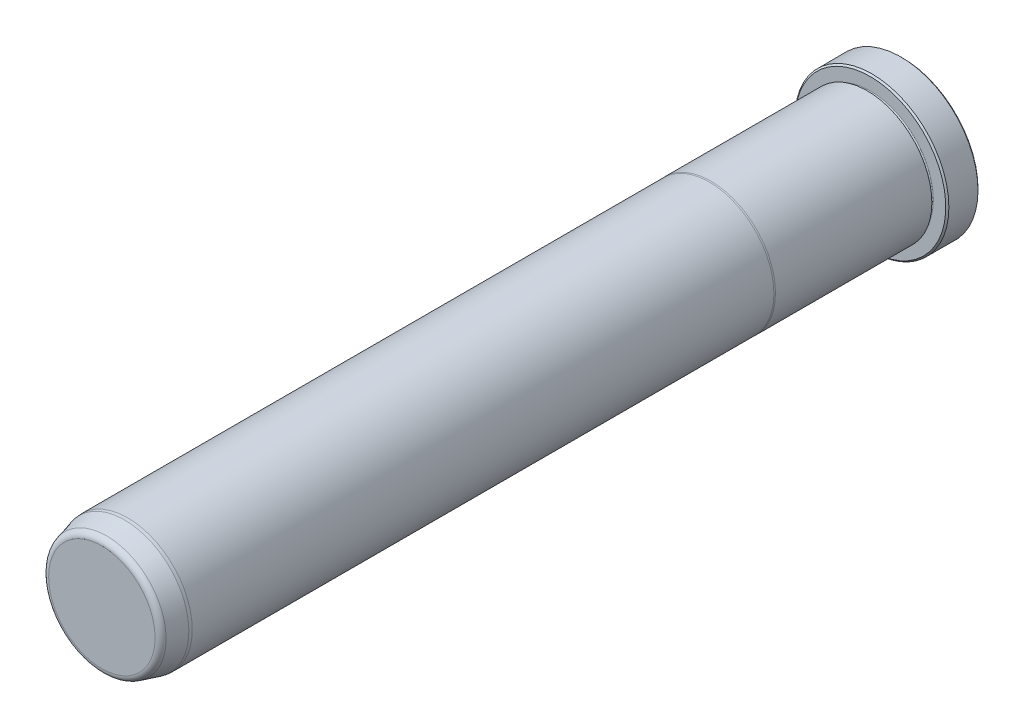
ISO-10303-21;
HEADER;
FILE_DESCRIPTION(('STEP AP214'),'2;1');
FILE_NAME('part.step','',(''),(''),'','','');
FILE_SCHEMA(('AUTOMOTIVE_DESIGN { 1 0 10303 214 1 1 1 1 }'));
ENDSEC;
DATA;
#1=APPLICATION_CONTEXT('core data for automotive mechanical design processes');
#2=APPLICATION_PROTOCOL_DEFINITION('international standard','automotive_design',2000,#1);
#3=PRODUCT_CONTEXT('',#1,'mechanical');
#4=PRODUCT('Part','Part','',(#3));
#5=PRODUCT_RELATED_PRODUCT_CATEGORY('part','',(#4));
#6=PRODUCT_DEFINITION_FORMATION('','',#4);
#7=PRODUCT_DEFINITION_CONTEXT('part definition',#1,'design');
#8=PRODUCT_DEFINITION('design','',#6,#7);
#9=PRODUCT_DEFINITION_SHAPE('','',#8);
#10=(LENGTH_UNIT() NAMED_UNIT(*) SI_UNIT(.MILLI.,.METRE.));
#11=(NAMED_UNIT(*) PLANE_ANGLE_UNIT() SI_UNIT($,.RADIAN.));
#12=(NAMED_UNIT(*) SI_UNIT($,.STERADIAN.) SOLID_ANGLE_UNIT());
#13=UNCERTAINTY_MEASURE_WITH_UNIT(LENGTH_MEASURE(1.E-05),#10,'distance_accuracy_value','');
#14=(GEOMETRIC_REPRESENTATION_CONTEXT(3) GLOBAL_UNCERTAINTY_ASSIGNED_CONTEXT((#13)) GLOBAL_UNIT_ASSIGNED_CONTEXT((#10,
#11,#12)) REPRESENTATION_CONTEXT('',''));
#15=CARTESIAN_POINT('',(0.,0.,0.));
#16=DIRECTION('',(0.,0.,1.));
#17=DIRECTION('',(1.,0.,0.));
#18=AXIS2_PLACEMENT_3D('',#15,#16,#17);
#19=CARTESIAN_POINT('',(0.,0.,0.));
#20=DIRECTION('',(0.,0.,1.));
#21=DIRECTION('',(1.,0.,0.));
#22=AXIS2_PLACEMENT_3D('',#19,#20,#21);
#23=PLANE('',#22);
#24=CARTESIAN_POINT('',(0.,0.,0.));
#25=DIRECTION('',(0.,0.,1.));
#26=DIRECTION('',(1.,0.,0.));
#27=AXIS2_PLACEMENT_3D('',#24,#25,#26);
#28=CIRCLE('',#27,18.542);
#29=CARTESIAN_POINT('',(18.542,0.,0.));
#30=VERTEX_POINT('',#29);
#31=EDGE_CURVE('E37',#30,#30,#28,.F.);
#32=ORIENTED_EDGE('',*,*,#31,.T.);
#33=EDGE_LOOP('',(#32));
#34=FACE_BOUND('',#33,.T.);
#35=ADVANCED_FACE('F30',(#34),#23,.F.);
#36=CARTESIAN_POINT('',(0.,0.,0.));
#37=DIRECTION('',(0.,0.,1.));
#38=DIRECTION('',(1.,0.,0.));
#39=AXIS2_PLACEMENT_3D('',#36,#37,#38);
#40=CYLINDRICAL_SURFACE('',#39,18.923);
#41=CARTESIAN_POINT('',(0.,0.,0.380999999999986));
#42=DIRECTION('',(0.,0.,1.));
#43=DIRECTION('',(1.,0.,0.));
#44=AXIS2_PLACEMENT_3D('',#41,#42,#43);
#45=CIRCLE('',#44,18.923);
#46=CARTESIAN_POINT('',(18.923,0.,0.380999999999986));
#47=VERTEX_POINT('',#46);
#48=EDGE_CURVE('E41',#47,#47,#45,.T.);
#49=ORIENTED_EDGE('',*,*,#48,.T.);
#50=EDGE_LOOP('',(#49));
#51=FACE_BOUND('',#50,.T.);
#52=CARTESIAN_POINT('',(0.,0.,7.54379999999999));
#53=DIRECTION('',(0.,0.,-1.));
#54=DIRECTION('',(-1.,0.,0.));
#55=AXIS2_PLACEMENT_3D('',#52,#53,#54);
#56=CIRCLE('',#55,18.923);
#57=CARTESIAN_POINT('',(-18.923,0.,7.54379999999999));
#58=VERTEX_POINT('',#57);
#59=EDGE_CURVE('E45',#58,#58,#56,.T.);
#60=ORIENTED_EDGE('',*,*,#59,.T.);
#61=EDGE_LOOP('',(#60));
#62=FACE_BOUND('',#61,.T.);
#63=ADVANCED_FACE('F118',(#51,#62),#40,.T.);
#64=CARTESIAN_POINT('',(0.,18.923,7.9248));
#65=DIRECTION('',(0.,0.,-1.));
#66=DIRECTION('',(-1.,0.,0.));
#67=AXIS2_PLACEMENT_3D('',#64,#65,#66);
#68=PLANE('',#67);
#69=CARTESIAN_POINT('',(0.,0.,7.9248));
#70=DIRECTION('',(0.,0.,-1.));
#71=DIRECTION('',(-1.,0.,0.));
#72=AXIS2_PLACEMENT_3D('',#69,#70,#71);
#73=CIRCLE('',#72,18.542);
#74=CARTESIAN_POINT('',(-18.542,0.,7.9248));
#75=VERTEX_POINT('',#74);
#76=EDGE_CURVE('E10',#75,#75,#73,.F.);
#77=ORIENTED_EDGE('',*,*,#76,.T.);
#78=EDGE_LOOP('',(#77));
#79=FACE_BOUND('',#78,.T.);
#80=CARTESIAN_POINT('',(0.,0.,7.9248));
#81=DIRECTION('',(0.,0.,1.));
#82=DIRECTION('',(1.,0.,0.));
#83=AXIS2_PLACEMENT_3D('',#80,#81,#82);
#84=CIRCLE('',#83,15.4813);
#85=CARTESIAN_POINT('',(15.4813,0.,7.9248));
#86=VERTEX_POINT('',#85);
#87=EDGE_CURVE('E56',#86,#86,#84,.T.);
#88=ORIENTED_EDGE('',*,*,#87,.F.);
#89=EDGE_LOOP('',(#88));
#90=FACE_BOUND('',#89,.T.);
#91=ADVANCED_FACE('F113',(#79,#90),#68,.F.);
#92=CARTESIAN_POINT('',(0.,0.,8.3058));
#93=DIRECTION('',(0.,0.,1.));
#94=DIRECTION('',(1.,0.,0.));
#95=AXIS2_PLACEMENT_3D('',#92,#93,#94);
#96=TOROIDAL_SURFACE('',#95,15.4813,0.381000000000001);
#97=CARTESIAN_POINT('',(0.,0.,8.6868));
#98=DIRECTION('',(0.,0.,1.));
#99=DIRECTION('',(1.,0.,0.));
#100=AXIS2_PLACEMENT_3D('',#97,#98,#99);
#101=CIRCLE('',#100,15.4813);
#102=CARTESIAN_POINT('',(15.4813,0.,8.6868));
#103=VERTEX_POINT('',#102);
#104=EDGE_CURVE('E59',#103,#103,#101,.T.);
#105=ORIENTED_EDGE('',*,*,#104,.F.);
#106=EDGE_LOOP('',(#105));
#107=FACE_BOUND('',#106,.T.);
#108=ORIENTED_EDGE('',*,*,#87,.T.);
#109=EDGE_LOOP('',(#108));
#110=FACE_BOUND('',#109,.T.);
#111=ADVANCED_FACE('F107',(#107,#110),#96,.F.);
#112=CARTESIAN_POINT('',(0.,15.4813,8.6868));
#113=DIRECTION('',(0.,0.,1.));
#114=DIRECTION('',(1.,0.,0.));
#115=AXIS2_PLACEMENT_3D('',#112,#113,#114);
#116=PLANE('',#115);
#117=CARTESIAN_POINT('',(0.,0.,8.6868));
#118=DIRECTION('',(0.,0.,1.));
#119=DIRECTION('',(1.,0.,0.));
#120=AXIS2_PLACEMENT_3D('',#117,#118,#119);
#121=CIRCLE('',#120,15.8877);
#122=CARTESIAN_POINT('',(15.8877,0.,8.6868));
#123=VERTEX_POINT('',#122);
#124=EDGE_CURVE('E62',#123,#123,#121,.T.);
#125=ORIENTED_EDGE('',*,*,#124,.F.);
#126=EDGE_LOOP('',(#125));
#127=FACE_BOUND('',#126,.T.);
#128=ORIENTED_EDGE('',*,*,#104,.T.);
#129=EDGE_LOOP('',(#128));
#130=FACE_BOUND('',#129,.T.);
#131=ADVANCED_FACE('F101',(#127,#130),#116,.F.);
#132=CARTESIAN_POINT('',(0.,0.,0.));
#133=DIRECTION('',(0.,0.,1.));
#134=DIRECTION('',(1.,0.,0.));
#135=AXIS2_PLACEMENT_3D('',#132,#133,#134);
#136=CYLINDRICAL_SURFACE('',#135,15.8877);
#137=CARTESIAN_POINT('',(0.,0.,47.1347630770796));
#138=DIRECTION('',(0.,0.,1.));
#139=DIRECTION('',(1.,0.,0.));
#140=AXIS2_PLACEMENT_3D('',#137,#138,#139);
#141=CIRCLE('',#140,15.8877);
#142=CARTESIAN_POINT('',(15.8877,0.,47.1347630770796));
#143=VERTEX_POINT('',#142);
#144=EDGE_CURVE('E65',#143,#143,#141,.T.);
#145=ORIENTED_EDGE('',*,*,#144,.F.);
#146=EDGE_LOOP('',(#145));
#147=FACE_BOUND('',#146,.T.);
#148=ORIENTED_EDGE('',*,*,#124,.T.);
#149=EDGE_LOOP('',(#148));
#150=FACE_BOUND('',#149,.T.);
#151=ADVANCED_FACE('F95',(#147,#150),#136,.T.);
#152=CARTESIAN_POINT('',(0.,0.,47.1347630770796));
#153=DIRECTION('',(0.,0.,-1.));
#154=DIRECTION('',(-1.,0.,0.));
#155=AXIS2_PLACEMENT_3D('',#152,#153,#154);
#156=CONICAL_SURFACE('',#155,15.8877,0.0698131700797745);
#157=CARTESIAN_POINT('',(0.,0.,47.498));
#158=DIRECTION('',(0.,0.,1.));
#159=DIRECTION('',(1.,0.,0.));
#160=AXIS2_PLACEMENT_3D('',#157,#158,#159);
#161=CIRCLE('',#160,15.8623);
#162=CARTESIAN_POINT('',(15.8623,0.,47.498));
#163=VERTEX_POINT('',#162);
#164=EDGE_CURVE('E68',#163,#163,#161,.T.);
#165=ORIENTED_EDGE('',*,*,#164,.F.);
#166=EDGE_LOOP('',(#165));
#167=FACE_BOUND('',#166,.T.);
#168=ORIENTED_EDGE('',*,*,#144,.T.);
#169=EDGE_LOOP('',(#168));
#170=FACE_BOUND('',#169,.T.);
#171=ADVANCED_FACE('F89',(#167,#170),#156,.T.);
#172=CARTESIAN_POINT('',(0.,0.,0.));
#173=DIRECTION('',(0.,0.,1.));
#174=DIRECTION('',(1.,0.,0.));
#175=AXIS2_PLACEMENT_3D('',#172,#173,#174);
#176=CYLINDRICAL_SURFACE('',#175,15.8623);
#177=CARTESIAN_POINT('',(0.,0.,190.5));
#178=DIRECTION('',(0.,0.,1.));
#179=DIRECTION('',(1.,0.,0.));
#180=AXIS2_PLACEMENT_3D('',#177,#178,#179);
#181=CIRCLE('',#180,15.8623);
#182=CARTESIAN_POINT('',(15.8623,0.,190.5));
#183=VERTEX_POINT('',#182);
#184=EDGE_CURVE('E71',#183,#183,#181,.T.);
#185=ORIENTED_EDGE('',*,*,#184,.F.);
#186=EDGE_LOOP('',(#185));
#187=FACE_BOUND('',#186,.T.);
#188=ORIENTED_EDGE('',*,*,#164,.T.);
#189=EDGE_LOOP('',(#188));
#190=FACE_BOUND('',#189,.T.);
#191=ADVANCED_FACE('F83',(#187,#190),#176,.T.);
#192=CARTESIAN_POINT('',(0.,0.,190.5));
#193=DIRECTION('',(0.,0.,-1.));
#194=DIRECTION('',(-1.,0.,0.));
#195=AXIS2_PLACEMENT_3D('',#192,#193,#194);
#196=CONICAL_SURFACE('',#195,15.8623,0.0872664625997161);
#197=CARTESIAN_POINT('',(0.,0.,191.262));
#198=DIRECTION('',(0.,0.,1.));
#199=DIRECTION('',(1.,0.,0.));
#200=AXIS2_PLACEMENT_3D('',#197,#198,#199);
#201=CIRCLE('',#200,15.7956336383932);
#202=CARTESIAN_POINT('',(15.7956336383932,0.,191.262));
#203=VERTEX_POINT('',#202);
#204=EDGE_CURVE('E74',#203,#203,#201,.T.);
#205=ORIENTED_EDGE('',*,*,#204,.F.);
#206=EDGE_LOOP('',(#205));
#207=FACE_BOUND('',#206,.T.);
#208=ORIENTED_EDGE('',*,*,#184,.T.);
#209=EDGE_LOOP('',(#208));
#210=FACE_BOUND('',#209,.T.);
#211=ADVANCED_FACE('F80',(#207,#210),#196,.T.);
#212=CARTESIAN_POINT('',(0.,0.,191.262));
#213=DIRECTION('',(0.,0.,-1.));
#214=DIRECTION('',(-1.,0.,0.));
#215=AXIS2_PLACEMENT_3D('',#212,#213,#214);
#216=CONICAL_SURFACE('',#215,15.7956336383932,0.26179938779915);
#217=CARTESIAN_POINT('',(0.,0.,195.6733752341));
#218=DIRECTION('',(0.,0.,1.));
#219=DIRECTION('',(1.,0.,0.));
#220=AXIS2_PLACEMENT_3D('',#217,#218,#219);
#221=CIRCLE('',#220,14.6136092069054);
#222=CARTESIAN_POINT('',(14.6136092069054,0.,195.6733752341));
#223=VERTEX_POINT('',#222);
#224=EDGE_CURVE('E50',#223,#223,#221,.F.);
#225=ORIENTED_EDGE('',*,*,#224,.T.);
#226=EDGE_LOOP('',(#225));
#227=FACE_BOUND('',#226,.T.);
#228=ORIENTED_EDGE('',*,*,#204,.T.);
#229=EDGE_LOOP('',(#228));
#230=FACE_BOUND('',#229,.T.);
#231=ADVANCED_FACE('F78',(#227,#230),#216,.T.);
#232=CARTESIAN_POINT('',(0.,14.2983335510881,196.85));
#233=DIRECTION('',(0.,0.,-1.));
#234=DIRECTION('',(-1.,0.,0.));
#235=AXIS2_PLACEMENT_3D('',#232,#233,#234);
#236=PLANE('',#235);
#237=CARTESIAN_POINT('',(0.,0.,196.85));
#238=DIRECTION('',(0.,0.,-1.));
#239=DIRECTION('',(-1.,0.,0.));
#240=AXIS2_PLACEMENT_3D('',#237,#238,#239);
#241=CIRCLE('',#240,13.0802019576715);
#242=CARTESIAN_POINT('',(-13.0802019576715,0.,196.85));
#243=VERTEX_POINT('',#242);
#244=EDGE_CURVE('E53',#243,#243,#241,.F.);
#245=ORIENTED_EDGE('',*,*,#244,.T.);
#246=EDGE_LOOP('',(#245));
#247=FACE_BOUND('',#246,.T.);
#248=ADVANCED_FACE('F133',(#247),#236,.F.);
#249=CARTESIAN_POINT('',(0.,0.,195.2625));
#250=DIRECTION('',(0.,0.,-1.));
#251=DIRECTION('',(-1.,0.,0.));
#252=AXIS2_PLACEMENT_3D('',#249,#250,#251);
#253=TOROIDAL_SURFACE('',#252,13.0802019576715,1.5875);
#254=ORIENTED_EDGE('',*,*,#224,.F.);
#255=EDGE_LOOP('',(#254));
#256=FACE_BOUND('',#255,.T.);
#257=ORIENTED_EDGE('',*,*,#244,.F.);
#258=EDGE_LOOP('',(#257));
#259=FACE_BOUND('',#258,.T.);
#260=ADVANCED_FACE('F130',(#256,#259),#253,.T.);
#261=CARTESIAN_POINT('',(0.,0.,0.380999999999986));
#262=DIRECTION('',(0.,0.,1.));
#263=DIRECTION('',(1.,0.,0.));
#264=AXIS2_PLACEMENT_3D('',#261,#262,#263);
#265=CONICAL_SURFACE('',#264,18.923,0.785398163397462);
#266=ORIENTED_EDGE('',*,*,#31,.F.);
#267=EDGE_LOOP('',(#266));
#268=FACE_BOUND('',#267,.T.);
#269=ORIENTED_EDGE('',*,*,#48,.F.);
#270=EDGE_LOOP('',(#269));
#271=FACE_BOUND('',#270,.T.);
#272=ADVANCED_FACE('F132',(#268,#271),#265,.T.);
#273=CARTESIAN_POINT('',(0.,0.,7.9248));
#274=DIRECTION('',(0.,0.,-1.));
#275=DIRECTION('',(-1.,0.,0.));
#276=AXIS2_PLACEMENT_3D('',#273,#274,#275);
#277=CONICAL_SURFACE('',#276,18.542,0.785398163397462);
#278=ORIENTED_EDGE('',*,*,#59,.F.);
#279=EDGE_LOOP('',(#278));
#280=FACE_BOUND('',#279,.T.);
#281=ORIENTED_EDGE('',*,*,#76,.F.);
#282=EDGE_LOOP('',(#281));
#283=FACE_BOUND('',#282,.T.);
#284=ADVANCED_FACE('F32',(#280,#283),#277,.T.);
#285=CLOSED_SHELL('',(#35,#63,#91,#111,#131,#151,#171,#191,#211,#231,#248,#260,#272,#284));
#286=MANIFOLD_SOLID_BREP('B2',#285);
#287=ADVANCED_BREP_SHAPE_REPRESENTATION('',(#18,#286),#14);
#288=SHAPE_DEFINITION_REPRESENTATION(#9,#287);
ENDSEC;
END-ISO-10303-21;
